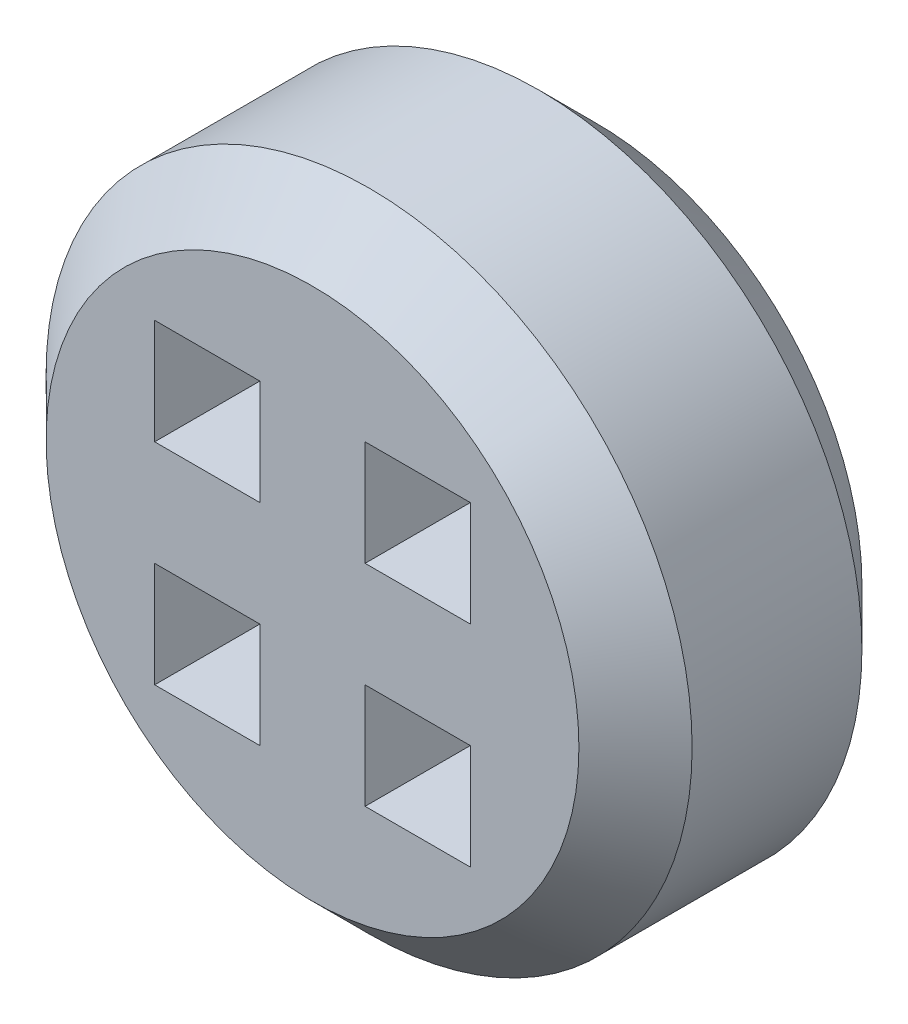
from build123d import *

# Parameters (mm, degrees)
SKICA1_R                 = 57.070956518
P_IDAT_VYSUNUT_M1_DEPTH  = 50
ODEBRAT_VYSUNUT_M3_REACH = 96.943
SKICA4_W                 = 18.591181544
SKICA4_H                 = 18.591181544
ZKOSEN_1_SIZE            = 10


with BuildPart() as part:
    # Skica1 → P_idat vysunut_m1 (new body)
    with BuildSketch(Plane.XY):
        Circle(SKICA1_R)
    extrude(amount=P_IDAT_VYSUNUT_M1_DEPTH)

    # Skica4 → Odebrat vysunut_m3 (cut, up to next)
    with BuildSketch(Plane.XY.offset(50), mode=Mode.PRIVATE) as odebrat_vysunut_m3_sk1:
        with Locations((18.591181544, 18.591181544)):
            Rectangle(SKICA4_W, SKICA4_H)
    odebrat_vysunut_m3_tool1 = extrude(odebrat_vysunut_m3_sk1.sketch, amount=-ODEBRAT_VYSUNUT_M3_REACH, mode=Mode.PRIVATE) & part.part
    # Skica4 → Odebrat vysunut_m3 (cut, up to next)
    with BuildSketch(Plane.XY.offset(50), mode=Mode.PRIVATE) as odebrat_vysunut_m3_sk2:
        with Locations((-18.591181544, 18.591181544)):
            Rectangle(SKICA4_W, SKICA4_H)
    odebrat_vysunut_m3_tool2 = extrude(odebrat_vysunut_m3_sk2.sketch, amount=-ODEBRAT_VYSUNUT_M3_REACH, mode=Mode.PRIVATE) & part.part
    # Skica4 → Odebrat vysunut_m3 (cut, up to next)
    with BuildSketch(Plane.XY.offset(50), mode=Mode.PRIVATE) as odebrat_vysunut_m3_sk3:
        with Locations((-18.591181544, -18.591181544)):
            Rectangle(SKICA4_W, SKICA4_H)
    odebrat_vysunut_m3_tool3 = extrude(odebrat_vysunut_m3_sk3.sketch, amount=-ODEBRAT_VYSUNUT_M3_REACH, mode=Mode.PRIVATE) & part.part
    # Skica4 → Odebrat vysunut_m3 (cut, up to next)
    with BuildSketch(Plane.XY.offset(50), mode=Mode.PRIVATE) as odebrat_vysunut_m3_sk4:
        with Locations((18.591181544, -18.591181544)):
            Rectangle(SKICA4_W, SKICA4_H)
    odebrat_vysunut_m3_tool4 = extrude(odebrat_vysunut_m3_sk4.sketch, amount=-ODEBRAT_VYSUNUT_M3_REACH, mode=Mode.PRIVATE) & part.part
    add(odebrat_vysunut_m3_tool1.solids().sort_by_distance((18.591182, 18.591182, 50))[0], mode=Mode.SUBTRACT)
    add(odebrat_vysunut_m3_tool2.solids().sort_by_distance((-18.591182, 18.591182, 50))[0], mode=Mode.SUBTRACT)
    add(odebrat_vysunut_m3_tool3.solids().sort_by_distance((-18.591182, -18.591182, 50))[0], mode=Mode.SUBTRACT)
    add(odebrat_vysunut_m3_tool4.solids().sort_by_distance((18.591182, -18.591182, 50))[0], mode=Mode.SUBTRACT)

    # Zkosen_1
    zkosen_1_edges = [part.edges().sort_by_distance(p)[0] for p in [
        (-57.070956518, 0, 0),
        (-57.070956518, 0, 50),
    ]]
    chamfer(zkosen_1_edges, length=ZKOSEN_1_SIZE)


solid = part.part
